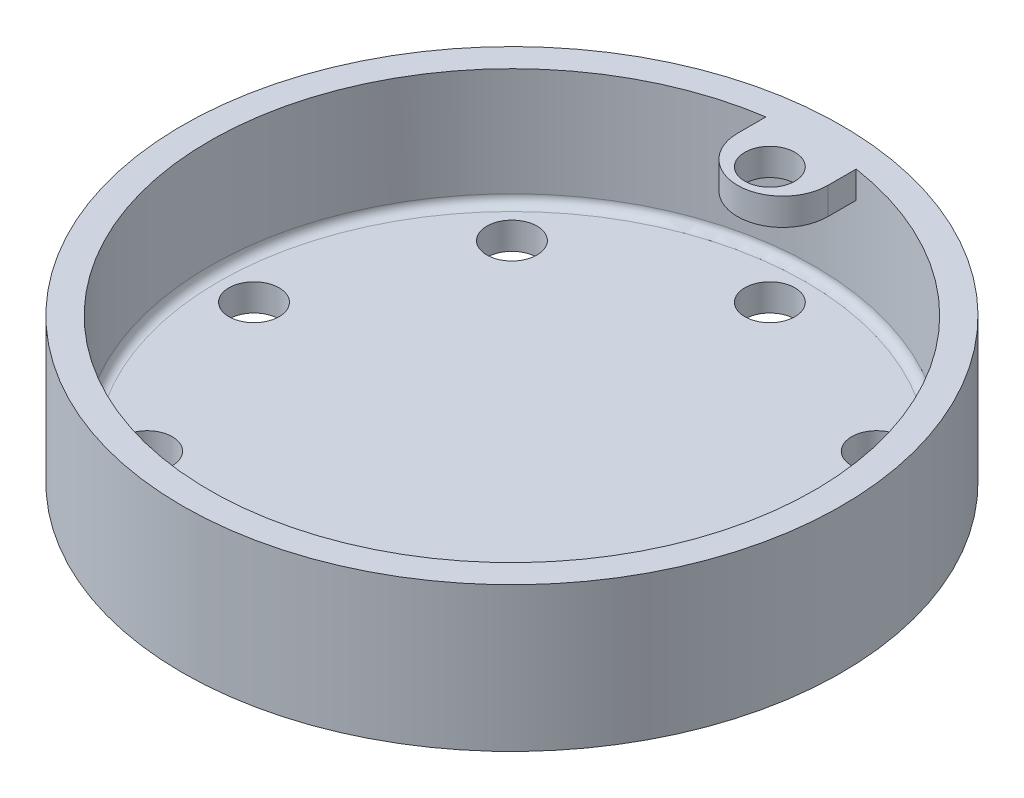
ISO-10303-21;
HEADER;
FILE_DESCRIPTION(('STEP AP214'),'2;1');
FILE_NAME('part.step','',(''),(''),'','','');
FILE_SCHEMA(('AUTOMOTIVE_DESIGN { 1 0 10303 214 1 1 1 1 }'));
ENDSEC;
DATA;
#1=APPLICATION_CONTEXT('core data for automotive mechanical design processes');
#2=APPLICATION_PROTOCOL_DEFINITION('international standard','automotive_design',2000,#1);
#3=PRODUCT_CONTEXT('',#1,'mechanical');
#4=PRODUCT('Part','Part','',(#3));
#5=PRODUCT_RELATED_PRODUCT_CATEGORY('part','',(#4));
#6=PRODUCT_DEFINITION_FORMATION('','',#4);
#7=PRODUCT_DEFINITION_CONTEXT('part definition',#1,'design');
#8=PRODUCT_DEFINITION('design','',#6,#7);
#9=PRODUCT_DEFINITION_SHAPE('','',#8);
#10=(LENGTH_UNIT() NAMED_UNIT(*) SI_UNIT(.MILLI.,.METRE.));
#11=(NAMED_UNIT(*) PLANE_ANGLE_UNIT() SI_UNIT($,.RADIAN.));
#12=(NAMED_UNIT(*) SI_UNIT($,.STERADIAN.) SOLID_ANGLE_UNIT());
#13=UNCERTAINTY_MEASURE_WITH_UNIT(LENGTH_MEASURE(1.E-05),#10,'distance_accuracy_value','');
#14=(GEOMETRIC_REPRESENTATION_CONTEXT(3) GLOBAL_UNCERTAINTY_ASSIGNED_CONTEXT((#13)) GLOBAL_UNIT_ASSIGNED_CONTEXT((#10,
#11,#12)) REPRESENTATION_CONTEXT('',''));
#15=CARTESIAN_POINT('',(0.,0.,0.));
#16=DIRECTION('',(0.,0.,1.));
#17=DIRECTION('',(1.,0.,0.));
#18=AXIS2_PLACEMENT_3D('',#15,#16,#17);
#19=CARTESIAN_POINT('',(0.,32.,0.));
#20=DIRECTION('',(0.,-1.,0.));
#21=DIRECTION('',(0.,0.,-1.));
#22=AXIS2_PLACEMENT_3D('',#19,#20,#21);
#23=CYLINDRICAL_SURFACE('',#22,67.025);
#24=CARTESIAN_POINT('',(0.,8.,0.));
#25=DIRECTION('',(0.,1.,0.));
#26=DIRECTION('',(0.,0.,1.));
#27=AXIS2_PLACEMENT_3D('',#24,#25,#26);
#28=CIRCLE('',#27,67.025);
#29=CARTESIAN_POINT('',(0.,8.,67.025));
#30=VERTEX_POINT('',#29);
#31=EDGE_CURVE('E11',#30,#30,#28,.F.);
#32=ORIENTED_EDGE('',*,*,#31,.T.);
#33=EDGE_LOOP('',(#32));
#34=FACE_BOUND('',#33,.T.);
#35=CARTESIAN_POINT('',(0.,32.,0.));
#36=DIRECTION('',(0.,1.,0.));
#37=DIRECTION('',(0.,0.,1.));
#38=AXIS2_PLACEMENT_3D('',#35,#36,#37);
#39=CIRCLE('',#38,67.025);
#40=CARTESIAN_POINT('',(-10.,32.,-66.2748113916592));
#41=VERTEX_POINT('',#40);
#42=CARTESIAN_POINT('',(10.,32.,-66.2748113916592));
#43=VERTEX_POINT('',#42);
#44=EDGE_CURVE('E107',#41,#43,#39,.T.);
#45=ORIENTED_EDGE('',*,*,#44,.T.);
#46=DIRECTION('',(0.,1.,0.));
#47=VECTOR('',#46,1.);
#48=CARTESIAN_POINT('',(10.,26.,-66.2748113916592));
#49=LINE('',#48,#47);
#50=CARTESIAN_POINT('',(10.,26.,-66.2748113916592));
#51=VERTEX_POINT('',#50);
#52=EDGE_CURVE('E52',#51,#43,#49,.T.);
#53=ORIENTED_EDGE('',*,*,#52,.F.);
#54=CARTESIAN_POINT('',(0.,26.,0.));
#55=DIRECTION('',(0.,1.,0.));
#56=DIRECTION('',(0.,0.,1.));
#57=AXIS2_PLACEMENT_3D('',#54,#55,#56);
#58=CIRCLE('',#57,67.025);
#59=CARTESIAN_POINT('',(-10.,26.,-66.2748113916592));
#60=VERTEX_POINT('',#59);
#61=EDGE_CURVE('E47',#51,#60,#58,.T.);
#62=ORIENTED_EDGE('',*,*,#61,.T.);
#63=DIRECTION('',(0.,1.,0.));
#64=VECTOR('',#63,1.);
#65=CARTESIAN_POINT('',(-10.,26.,-66.2748113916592));
#66=LINE('',#65,#64);
#67=EDGE_CURVE('E92',#60,#41,#66,.T.);
#68=ORIENTED_EDGE('',*,*,#67,.T.);
#69=EDGE_LOOP('',(#45,#53,#62,#68));
#70=FACE_BOUND('',#69,.T.);
#71=ADVANCED_FACE('F32',(#34,#70),#23,.F.);
#72=CARTESIAN_POINT('',(0.,32.,0.));
#73=DIRECTION('',(0.,-1.,0.));
#74=DIRECTION('',(0.,0.,-1.));
#75=AXIS2_PLACEMENT_3D('',#72,#73,#74);
#76=CYLINDRICAL_SURFACE('',#75,73.025);
#77=CARTESIAN_POINT('',(0.,32.,0.));
#78=DIRECTION('',(0.,1.,0.));
#79=DIRECTION('',(0.,0.,1.));
#80=AXIS2_PLACEMENT_3D('',#77,#78,#79);
#81=CIRCLE('',#80,73.025);
#82=CARTESIAN_POINT('',(0.,32.,73.025));
#83=VERTEX_POINT('',#82);
#84=EDGE_CURVE('E112',#83,#83,#81,.T.);
#85=ORIENTED_EDGE('',*,*,#84,.F.);
#86=EDGE_LOOP('',(#85));
#87=FACE_BOUND('',#86,.T.);
#88=CARTESIAN_POINT('',(0.,0.,0.));
#89=DIRECTION('',(0.,1.,0.));
#90=DIRECTION('',(0.,0.,1.));
#91=AXIS2_PLACEMENT_3D('',#88,#89,#90);
#92=CIRCLE('',#91,73.025);
#93=CARTESIAN_POINT('',(0.,0.,73.025));
#94=VERTEX_POINT('',#93);
#95=EDGE_CURVE('E111',#94,#94,#92,.T.);
#96=ORIENTED_EDGE('',*,*,#95,.T.);
#97=EDGE_LOOP('',(#96));
#98=FACE_BOUND('',#97,.T.);
#99=ADVANCED_FACE('F133',(#87,#98),#76,.T.);
#100=CARTESIAN_POINT('',(0.,32.,0.));
#101=DIRECTION('',(0.,1.,0.));
#102=DIRECTION('',(0.,0.,1.));
#103=AXIS2_PLACEMENT_3D('',#100,#101,#102);
#104=PLANE('',#103);
#105=CARTESIAN_POINT('',(0.,32.,-57.15));
#106=DIRECTION('',(0.,1.,0.));
#107=DIRECTION('',(0.,0.,1.));
#108=AXIS2_PLACEMENT_3D('',#105,#106,#107);
#109=CIRCLE('',#108,5.55625);
#110=CARTESIAN_POINT('',(0.,32.,-51.59375));
#111=VERTEX_POINT('',#110);
#112=EDGE_CURVE('E190',#111,#111,#109,.T.);
#113=ORIENTED_EDGE('',*,*,#112,.F.);
#114=EDGE_LOOP('',(#113));
#115=FACE_BOUND('',#114,.T.);
#116=ORIENTED_EDGE('',*,*,#44,.F.);
#117=DIRECTION('',(0.,0.,-1.));
#118=VECTOR('',#117,1.);
#119=CARTESIAN_POINT('',(-10.,32.,-60.));
#120=LINE('',#119,#118);
#121=CARTESIAN_POINT('',(-10.,32.,-60.));
#122=VERTEX_POINT('',#121);
#123=EDGE_CURVE('E101',#122,#41,#120,.T.);
#124=ORIENTED_EDGE('',*,*,#123,.F.);
#125=CARTESIAN_POINT('',(0.,32.,-60.));
#126=DIRECTION('',(0.,-1.,0.));
#127=DIRECTION('',(0.,0.,-1.));
#128=AXIS2_PLACEMENT_3D('',#125,#126,#127);
#129=CIRCLE('',#128,10.);
#130=CARTESIAN_POINT('',(10.,32.,-60.));
#131=VERTEX_POINT('',#130);
#132=EDGE_CURVE('E87',#131,#122,#129,.T.);
#133=ORIENTED_EDGE('',*,*,#132,.F.);
#134=DIRECTION('',(0.,0.,1.));
#135=VECTOR('',#134,1.);
#136=CARTESIAN_POINT('',(10.,32.,-66.2748113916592));
#137=LINE('',#136,#135);
#138=EDGE_CURVE('E96',#43,#131,#137,.T.);
#139=ORIENTED_EDGE('',*,*,#138,.F.);
#140=EDGE_LOOP('',(#116,#124,#133,#139));
#141=FACE_BOUND('',#140,.T.);
#142=ORIENTED_EDGE('',*,*,#84,.T.);
#143=EDGE_LOOP('',(#142));
#144=FACE_BOUND('',#143,.T.);
#145=ADVANCED_FACE('F139',(#115,#141,#144),#104,.T.);
#146=CARTESIAN_POINT('',(0.,0.,0.));
#147=DIRECTION('',(0.,1.,0.));
#148=DIRECTION('',(0.,0.,1.));
#149=AXIS2_PLACEMENT_3D('',#146,#147,#148);
#150=PLANE('',#149);
#151=CARTESIAN_POINT('',(-40.4111525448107,0.,-40.4111525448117));
#152=DIRECTION('',(0.,1.,0.));
#153=DIRECTION('',(0.707106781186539,0.,0.707106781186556));
#154=AXIS2_PLACEMENT_3D('',#151,#152,#153);
#155=CIRCLE('',#154,5.55625);
#156=CARTESIAN_POINT('',(-36.482290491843,0.,-36.4822904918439));
#157=VERTEX_POINT('',#156);
#158=EDGE_CURVE('E158',#157,#157,#155,.T.);
#159=ORIENTED_EDGE('',*,*,#158,.T.);
#160=EDGE_LOOP('',(#159));
#161=FACE_BOUND('',#160,.T.);
#162=CARTESIAN_POINT('',(-57.15,0.,-5.98614475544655E-13));
#163=DIRECTION('',(0.,1.,0.));
#164=DIRECTION('',(1.,0.,0.));
#165=AXIS2_PLACEMENT_3D('',#162,#163,#164);
#166=CIRCLE('',#165,5.55625);
#167=CARTESIAN_POINT('',(-51.59375,0.,-5.40415845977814E-13));
#168=VERTEX_POINT('',#167);
#169=EDGE_CURVE('E162',#168,#168,#166,.T.);
#170=ORIENTED_EDGE('',*,*,#169,.T.);
#171=EDGE_LOOP('',(#170));
#172=FACE_BOUND('',#171,.T.);
#173=CARTESIAN_POINT('',(-40.4111525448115,0.,40.4111525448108));
#174=DIRECTION('',(0.,1.,0.));
#175=DIRECTION('',(0.707106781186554,0.,-0.707106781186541));
#176=AXIS2_PLACEMENT_3D('',#173,#174,#175);
#177=CIRCLE('',#176,5.55625);
#178=CARTESIAN_POINT('',(-36.4822904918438,0.,36.4822904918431));
#179=VERTEX_POINT('',#178);
#180=EDGE_CURVE('E166',#179,#179,#177,.T.);
#181=ORIENTED_EDGE('',*,*,#180,.T.);
#182=EDGE_LOOP('',(#181));
#183=FACE_BOUND('',#182,.T.);
#184=CARTESIAN_POINT('',(-3.9907631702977E-13,0.,57.15));
#185=DIRECTION('',(0.,1.,0.));
#186=DIRECTION('',(0.,0.,-1.));
#187=AXIS2_PLACEMENT_3D('',#184,#185,#186);
#188=CIRCLE('',#187,5.55625);
#189=CARTESIAN_POINT('',(-3.60277230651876E-13,0.,51.59375));
#190=VERTEX_POINT('',#189);
#191=EDGE_CURVE('E170',#190,#190,#188,.T.);
#192=ORIENTED_EDGE('',*,*,#191,.T.);
#193=EDGE_LOOP('',(#192));
#194=FACE_BOUND('',#193,.T.);
#195=CARTESIAN_POINT('',(40.411152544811,0.,40.4111525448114));
#196=DIRECTION('',(0.,1.,0.));
#197=DIRECTION('',(-0.707106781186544,0.,-0.707106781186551));
#198=AXIS2_PLACEMENT_3D('',#195,#196,#197);
#199=CIRCLE('',#198,5.55625);
#200=CARTESIAN_POINT('',(36.4822904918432,0.,36.4822904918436));
#201=VERTEX_POINT('',#200);
#202=EDGE_CURVE('E174',#201,#201,#199,.T.);
#203=ORIENTED_EDGE('',*,*,#202,.T.);
#204=EDGE_LOOP('',(#203));
#205=FACE_BOUND('',#204,.T.);
#206=CARTESIAN_POINT('',(57.15,0.,1.99538158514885E-13));
#207=DIRECTION('',(0.,1.,0.));
#208=DIRECTION('',(-1.,0.,0.));
#209=AXIS2_PLACEMENT_3D('',#206,#207,#208);
#210=CIRCLE('',#209,5.55625);
#211=CARTESIAN_POINT('',(51.59375,0.,1.80138615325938E-13));
#212=VERTEX_POINT('',#211);
#213=EDGE_CURVE('E178',#212,#212,#210,.T.);
#214=ORIENTED_EDGE('',*,*,#213,.T.);
#215=EDGE_LOOP('',(#214));
#216=FACE_BOUND('',#215,.T.);
#217=CARTESIAN_POINT('',(40.4111525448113,0.,-40.4111525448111));
#218=DIRECTION('',(0.,1.,0.));
#219=DIRECTION('',(-0.707106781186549,0.,0.707106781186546));
#220=AXIS2_PLACEMENT_3D('',#217,#218,#219);
#221=CIRCLE('',#220,5.55625);
#222=CARTESIAN_POINT('',(36.4822904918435,0.,-36.4822904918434));
#223=VERTEX_POINT('',#222);
#224=EDGE_CURVE('E182',#223,#223,#221,.T.);
#225=ORIENTED_EDGE('',*,*,#224,.T.);
#226=EDGE_LOOP('',(#225));
#227=FACE_BOUND('',#226,.T.);
#228=CARTESIAN_POINT('',(0.,0.,-57.15));
#229=DIRECTION('',(0.,1.,0.));
#230=DIRECTION('',(0.,0.,1.));
#231=AXIS2_PLACEMENT_3D('',#228,#229,#230);
#232=CIRCLE('',#231,5.55625);
#233=CARTESIAN_POINT('',(0.,0.,-51.59375));
#234=VERTEX_POINT('',#233);
#235=EDGE_CURVE('E186',#234,#234,#232,.T.);
#236=ORIENTED_EDGE('',*,*,#235,.T.);
#237=EDGE_LOOP('',(#236));
#238=FACE_BOUND('',#237,.T.);
#239=ORIENTED_EDGE('',*,*,#95,.F.);
#240=EDGE_LOOP('',(#239));
#241=FACE_BOUND('',#240,.T.);
#242=ADVANCED_FACE('F147',(#161,#172,#183,#194,#205,#216,#227,#238,#241),#150,.F.);
#243=CARTESIAN_POINT('',(0.,6.,0.));
#244=DIRECTION('',(0.,1.,0.));
#245=DIRECTION('',(0.,0.,1.));
#246=AXIS2_PLACEMENT_3D('',#243,#244,#245);
#247=PLANE('',#246);
#248=CARTESIAN_POINT('',(0.,6.,0.));
#249=DIRECTION('',(0.,1.,0.));
#250=DIRECTION('',(0.,0.,1.));
#251=AXIS2_PLACEMENT_3D('',#248,#249,#250);
#252=CIRCLE('',#251,65.025);
#253=CARTESIAN_POINT('',(0.,6.,65.025));
#254=VERTEX_POINT('',#253);
#255=EDGE_CURVE('E40',#254,#254,#252,.T.);
#256=ORIENTED_EDGE('',*,*,#255,.T.);
#257=EDGE_LOOP('',(#256));
#258=FACE_BOUND('',#257,.T.);
#259=CARTESIAN_POINT('',(-40.4111525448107,6.,-40.4111525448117));
#260=DIRECTION('',(0.,1.,0.));
#261=DIRECTION('',(0.707106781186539,0.,0.707106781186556));
#262=AXIS2_PLACEMENT_3D('',#259,#260,#261);
#263=CIRCLE('',#262,5.55625);
#264=CARTESIAN_POINT('',(-36.482290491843,6.,-36.4822904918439));
#265=VERTEX_POINT('',#264);
#266=EDGE_CURVE('E347',#265,#265,#263,.T.);
#267=ORIENTED_EDGE('',*,*,#266,.F.);
#268=EDGE_LOOP('',(#267));
#269=FACE_BOUND('',#268,.T.);
#270=CARTESIAN_POINT('',(-57.15,6.,-5.98614475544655E-13));
#271=DIRECTION('',(0.,1.,0.));
#272=DIRECTION('',(1.,0.,0.));
#273=AXIS2_PLACEMENT_3D('',#270,#271,#272);
#274=CIRCLE('',#273,5.55625);
#275=CARTESIAN_POINT('',(-51.59375,6.,-5.40415845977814E-13));
#276=VERTEX_POINT('',#275);
#277=EDGE_CURVE('E342',#276,#276,#274,.T.);
#278=ORIENTED_EDGE('',*,*,#277,.F.);
#279=EDGE_LOOP('',(#278));
#280=FACE_BOUND('',#279,.T.);
#281=CARTESIAN_POINT('',(-40.4111525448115,6.,40.4111525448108));
#282=DIRECTION('',(0.,1.,0.));
#283=DIRECTION('',(0.707106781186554,0.,-0.707106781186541));
#284=AXIS2_PLACEMENT_3D('',#281,#282,#283);
#285=CIRCLE('',#284,5.55625);
#286=CARTESIAN_POINT('',(-36.4822904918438,6.,36.4822904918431));
#287=VERTEX_POINT('',#286);
#288=EDGE_CURVE('E345',#287,#287,#285,.T.);
#289=ORIENTED_EDGE('',*,*,#288,.F.);
#290=EDGE_LOOP('',(#289));
#291=FACE_BOUND('',#290,.T.);
#292=CARTESIAN_POINT('',(-3.9907631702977E-13,6.,57.15));
#293=DIRECTION('',(0.,1.,0.));
#294=DIRECTION('',(0.,0.,-1.));
#295=AXIS2_PLACEMENT_3D('',#292,#293,#294);
#296=CIRCLE('',#295,5.55625);
#297=CARTESIAN_POINT('',(-3.60277230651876E-13,6.,51.59375));
#298=VERTEX_POINT('',#297);
#299=EDGE_CURVE('E352',#298,#298,#296,.T.);
#300=ORIENTED_EDGE('',*,*,#299,.F.);
#301=EDGE_LOOP('',(#300));
#302=FACE_BOUND('',#301,.T.);
#303=CARTESIAN_POINT('',(40.411152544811,6.,40.4111525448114));
#304=DIRECTION('',(0.,1.,0.));
#305=DIRECTION('',(-0.707106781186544,0.,-0.707106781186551));
#306=AXIS2_PLACEMENT_3D('',#303,#304,#305);
#307=CIRCLE('',#306,5.55625);
#308=CARTESIAN_POINT('',(36.4822904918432,6.,36.4822904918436));
#309=VERTEX_POINT('',#308);
#310=EDGE_CURVE('E356',#309,#309,#307,.T.);
#311=ORIENTED_EDGE('',*,*,#310,.F.);
#312=EDGE_LOOP('',(#311));
#313=FACE_BOUND('',#312,.T.);
#314=CARTESIAN_POINT('',(57.15,6.,1.99538158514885E-13));
#315=DIRECTION('',(0.,1.,0.));
#316=DIRECTION('',(-1.,0.,0.));
#317=AXIS2_PLACEMENT_3D('',#314,#315,#316);
#318=CIRCLE('',#317,5.55625);
#319=CARTESIAN_POINT('',(51.59375,6.,1.80138615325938E-13));
#320=VERTEX_POINT('',#319);
#321=EDGE_CURVE('E360',#320,#320,#318,.T.);
#322=ORIENTED_EDGE('',*,*,#321,.F.);
#323=EDGE_LOOP('',(#322));
#324=FACE_BOUND('',#323,.T.);
#325=CARTESIAN_POINT('',(40.4111525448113,6.,-40.4111525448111));
#326=DIRECTION('',(0.,1.,0.));
#327=DIRECTION('',(-0.707106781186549,0.,0.707106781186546));
#328=AXIS2_PLACEMENT_3D('',#325,#326,#327);
#329=CIRCLE('',#328,5.55625);
#330=CARTESIAN_POINT('',(36.4822904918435,6.,-36.4822904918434));
#331=VERTEX_POINT('',#330);
#332=EDGE_CURVE('E198',#331,#331,#329,.T.);
#333=ORIENTED_EDGE('',*,*,#332,.F.);
#334=EDGE_LOOP('',(#333));
#335=FACE_BOUND('',#334,.T.);
#336=CARTESIAN_POINT('',(0.,6.,-57.15));
#337=DIRECTION('',(0.,1.,0.));
#338=DIRECTION('',(0.,0.,1.));
#339=AXIS2_PLACEMENT_3D('',#336,#337,#338);
#340=CIRCLE('',#339,5.55625);
#341=CARTESIAN_POINT('',(0.,6.,-51.59375));
#342=VERTEX_POINT('',#341);
#343=EDGE_CURVE('E191',#342,#342,#340,.T.);
#344=ORIENTED_EDGE('',*,*,#343,.F.);
#345=EDGE_LOOP('',(#344));
#346=FACE_BOUND('',#345,.T.);
#347=ADVANCED_FACE('F119',(#258,#269,#280,#291,#302,#313,#324,#335,#346),#247,.T.);
#348=CARTESIAN_POINT('',(10.,26.,-66.2748113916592));
#349=DIRECTION('',(-1.,0.,0.));
#350=DIRECTION('',(0.,0.,1.));
#351=AXIS2_PLACEMENT_3D('',#348,#349,#350);
#352=PLANE('',#351);
#353=ORIENTED_EDGE('',*,*,#138,.T.);
#354=DIRECTION('',(0.,1.,0.));
#355=VECTOR('',#354,1.);
#356=CARTESIAN_POINT('',(10.,26.,-60.));
#357=LINE('',#356,#355);
#358=CARTESIAN_POINT('',(10.,26.,-60.));
#359=VERTEX_POINT('',#358);
#360=EDGE_CURVE('E91',#359,#131,#357,.T.);
#361=ORIENTED_EDGE('',*,*,#360,.F.);
#362=DIRECTION('',(0.,0.,1.));
#363=VECTOR('',#362,1.);
#364=CARTESIAN_POINT('',(10.,26.,-66.2748113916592));
#365=LINE('',#364,#363);
#366=EDGE_CURVE('E78',#51,#359,#365,.T.);
#367=ORIENTED_EDGE('',*,*,#366,.F.);
#368=ORIENTED_EDGE('',*,*,#52,.T.);
#369=EDGE_LOOP('',(#353,#361,#367,#368));
#370=FACE_BOUND('',#369,.T.);
#371=ADVANCED_FACE('F146',(#370),#352,.F.);
#372=CARTESIAN_POINT('',(0.,26.,-60.));
#373=DIRECTION('',(0.,1.,0.));
#374=DIRECTION('',(0.,0.,1.));
#375=AXIS2_PLACEMENT_3D('',#372,#373,#374);
#376=CYLINDRICAL_SURFACE('',#375,10.);
#377=ORIENTED_EDGE('',*,*,#132,.T.);
#378=DIRECTION('',(0.,1.,0.));
#379=VECTOR('',#378,1.);
#380=CARTESIAN_POINT('',(-10.,26.,-60.));
#381=LINE('',#380,#379);
#382=CARTESIAN_POINT('',(-10.,26.,-60.));
#383=VERTEX_POINT('',#382);
#384=EDGE_CURVE('E84',#383,#122,#381,.T.);
#385=ORIENTED_EDGE('',*,*,#384,.F.);
#386=CARTESIAN_POINT('',(0.,26.,-60.));
#387=DIRECTION('',(0.,-1.,0.));
#388=DIRECTION('',(0.,0.,-1.));
#389=AXIS2_PLACEMENT_3D('',#386,#387,#388);
#390=CIRCLE('',#389,10.);
#391=EDGE_CURVE('E72',#359,#383,#390,.T.);
#392=ORIENTED_EDGE('',*,*,#391,.F.);
#393=ORIENTED_EDGE('',*,*,#360,.T.);
#394=EDGE_LOOP('',(#377,#385,#392,#393));
#395=FACE_BOUND('',#394,.T.);
#396=ADVANCED_FACE('F85',(#395),#376,.T.);
#397=CARTESIAN_POINT('',(-10.,26.,-60.));
#398=DIRECTION('',(1.,0.,0.));
#399=DIRECTION('',(0.,0.,-1.));
#400=AXIS2_PLACEMENT_3D('',#397,#398,#399);
#401=PLANE('',#400);
#402=ORIENTED_EDGE('',*,*,#123,.T.);
#403=ORIENTED_EDGE('',*,*,#67,.F.);
#404=DIRECTION('',(0.,0.,-1.));
#405=VECTOR('',#404,1.);
#406=CARTESIAN_POINT('',(-10.,26.,-60.));
#407=LINE('',#406,#405);
#408=EDGE_CURVE('E76',#383,#60,#407,.T.);
#409=ORIENTED_EDGE('',*,*,#408,.F.);
#410=ORIENTED_EDGE('',*,*,#384,.T.);
#411=EDGE_LOOP('',(#402,#403,#409,#410));
#412=FACE_BOUND('',#411,.T.);
#413=ADVANCED_FACE('F94',(#412),#401,.F.);
#414=CARTESIAN_POINT('',(0.,26.,0.));
#415=DIRECTION('',(0.,1.,0.));
#416=DIRECTION('',(0.,0.,1.));
#417=AXIS2_PLACEMENT_3D('',#414,#415,#416);
#418=PLANE('',#417);
#419=CARTESIAN_POINT('',(0.,26.,-57.15));
#420=DIRECTION('',(0.,1.,0.));
#421=DIRECTION('',(0.,0.,1.));
#422=AXIS2_PLACEMENT_3D('',#419,#420,#421);
#423=CIRCLE('',#422,5.55625);
#424=CARTESIAN_POINT('',(0.,26.,-51.59375));
#425=VERTEX_POINT('',#424);
#426=EDGE_CURVE('E103',#425,#425,#423,.F.);
#427=ORIENTED_EDGE('',*,*,#426,.F.);
#428=EDGE_LOOP('',(#427));
#429=FACE_BOUND('',#428,.T.);
#430=ORIENTED_EDGE('',*,*,#61,.F.);
#431=ORIENTED_EDGE('',*,*,#366,.T.);
#432=ORIENTED_EDGE('',*,*,#391,.T.);
#433=ORIENTED_EDGE('',*,*,#408,.T.);
#434=EDGE_LOOP('',(#430,#431,#432,#433));
#435=FACE_BOUND('',#434,.T.);
#436=ADVANCED_FACE('F74',(#429,#435),#418,.F.);
#437=CARTESIAN_POINT('',(0.,-0.001000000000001,-57.15));
#438=DIRECTION('',(0.,1.,0.));
#439=DIRECTION('',(0.,0.,1.));
#440=AXIS2_PLACEMENT_3D('',#437,#438,#439);
#441=CYLINDRICAL_SURFACE('',#440,5.55625);
#442=ORIENTED_EDGE('',*,*,#112,.T.);
#443=EDGE_LOOP('',(#442));
#444=FACE_BOUND('',#443,.T.);
#445=ORIENTED_EDGE('',*,*,#426,.T.);
#446=EDGE_LOOP('',(#445));
#447=FACE_BOUND('',#446,.T.);
#448=ADVANCED_FACE('F203',(#444,#447),#441,.F.);
#449=CARTESIAN_POINT('',(0.,0.,-57.15));
#450=DIRECTION('',(0.,1.,0.));
#451=DIRECTION('',(0.,0.,1.));
#452=AXIS2_PLACEMENT_3D('',#449,#450,#451);
#453=CYLINDRICAL_SURFACE('',#452,5.55625);
#454=ORIENTED_EDGE('',*,*,#235,.F.);
#455=EDGE_LOOP('',(#454));
#456=FACE_BOUND('',#455,.T.);
#457=ORIENTED_EDGE('',*,*,#343,.T.);
#458=EDGE_LOOP('',(#457));
#459=FACE_BOUND('',#458,.T.);
#460=ADVANCED_FACE('F211',(#456,#459),#453,.F.);
#461=CARTESIAN_POINT('',(40.4111525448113,0.,-40.4111525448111));
#462=DIRECTION('',(0.,1.,0.));
#463=DIRECTION('',(0.,0.,1.));
#464=AXIS2_PLACEMENT_3D('',#461,#462,#463);
#465=CYLINDRICAL_SURFACE('',#464,5.55625);
#466=ORIENTED_EDGE('',*,*,#224,.F.);
#467=EDGE_LOOP('',(#466));
#468=FACE_BOUND('',#467,.T.);
#469=ORIENTED_EDGE('',*,*,#332,.T.);
#470=EDGE_LOOP('',(#469));
#471=FACE_BOUND('',#470,.T.);
#472=ADVANCED_FACE('F254',(#468,#471),#465,.F.);
#473=CARTESIAN_POINT('',(57.15,0.,1.99538158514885E-13));
#474=DIRECTION('',(0.,1.,0.));
#475=DIRECTION('',(0.,0.,1.));
#476=AXIS2_PLACEMENT_3D('',#473,#474,#475);
#477=CYLINDRICAL_SURFACE('',#476,5.55625);
#478=ORIENTED_EDGE('',*,*,#213,.F.);
#479=EDGE_LOOP('',(#478));
#480=FACE_BOUND('',#479,.T.);
#481=ORIENTED_EDGE('',*,*,#321,.T.);
#482=EDGE_LOOP('',(#481));
#483=FACE_BOUND('',#482,.T.);
#484=ADVANCED_FACE('F268',(#480,#483),#477,.F.);
#485=CARTESIAN_POINT('',(40.411152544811,0.,40.4111525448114));
#486=DIRECTION('',(0.,1.,0.));
#487=DIRECTION('',(0.,0.,1.));
#488=AXIS2_PLACEMENT_3D('',#485,#486,#487);
#489=CYLINDRICAL_SURFACE('',#488,5.55625);
#490=ORIENTED_EDGE('',*,*,#202,.F.);
#491=EDGE_LOOP('',(#490));
#492=FACE_BOUND('',#491,.T.);
#493=ORIENTED_EDGE('',*,*,#310,.T.);
#494=EDGE_LOOP('',(#493));
#495=FACE_BOUND('',#494,.T.);
#496=ADVANCED_FACE('F278',(#492,#495),#489,.F.);
#497=CARTESIAN_POINT('',(-3.9907631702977E-13,0.,57.15));
#498=DIRECTION('',(0.,1.,0.));
#499=DIRECTION('',(0.,0.,1.));
#500=AXIS2_PLACEMENT_3D('',#497,#498,#499);
#501=CYLINDRICAL_SURFACE('',#500,5.55625);
#502=ORIENTED_EDGE('',*,*,#191,.F.);
#503=EDGE_LOOP('',(#502));
#504=FACE_BOUND('',#503,.T.);
#505=ORIENTED_EDGE('',*,*,#299,.T.);
#506=EDGE_LOOP('',(#505));
#507=FACE_BOUND('',#506,.T.);
#508=ADVANCED_FACE('F288',(#504,#507),#501,.F.);
#509=CARTESIAN_POINT('',(-40.4111525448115,0.,40.4111525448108));
#510=DIRECTION('',(0.,1.,0.));
#511=DIRECTION('',(0.,0.,1.));
#512=AXIS2_PLACEMENT_3D('',#509,#510,#511);
#513=CYLINDRICAL_SURFACE('',#512,5.55625);
#514=ORIENTED_EDGE('',*,*,#180,.F.);
#515=EDGE_LOOP('',(#514));
#516=FACE_BOUND('',#515,.T.);
#517=ORIENTED_EDGE('',*,*,#288,.T.);
#518=EDGE_LOOP('',(#517));
#519=FACE_BOUND('',#518,.T.);
#520=ADVANCED_FACE('F298',(#516,#519),#513,.F.);
#521=CARTESIAN_POINT('',(-57.15,0.,-5.98614475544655E-13));
#522=DIRECTION('',(0.,1.,0.));
#523=DIRECTION('',(0.,0.,1.));
#524=AXIS2_PLACEMENT_3D('',#521,#522,#523);
#525=CYLINDRICAL_SURFACE('',#524,5.55625);
#526=ORIENTED_EDGE('',*,*,#169,.F.);
#527=EDGE_LOOP('',(#526));
#528=FACE_BOUND('',#527,.T.);
#529=ORIENTED_EDGE('',*,*,#277,.T.);
#530=EDGE_LOOP('',(#529));
#531=FACE_BOUND('',#530,.T.);
#532=ADVANCED_FACE('F128',(#528,#531),#525,.F.);
#533=CARTESIAN_POINT('',(-40.4111525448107,0.,-40.4111525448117));
#534=DIRECTION('',(0.,1.,0.));
#535=DIRECTION('',(0.,0.,1.));
#536=AXIS2_PLACEMENT_3D('',#533,#534,#535);
#537=CYLINDRICAL_SURFACE('',#536,5.55625);
#538=ORIENTED_EDGE('',*,*,#158,.F.);
#539=EDGE_LOOP('',(#538));
#540=FACE_BOUND('',#539,.T.);
#541=ORIENTED_EDGE('',*,*,#266,.T.);
#542=EDGE_LOOP('',(#541));
#543=FACE_BOUND('',#542,.T.);
#544=ADVANCED_FACE('F123',(#540,#543),#537,.F.);
#545=CARTESIAN_POINT('',(0.,8.,0.));
#546=DIRECTION('',(0.,1.,0.));
#547=DIRECTION('',(0.,0.,1.));
#548=AXIS2_PLACEMENT_3D('',#545,#546,#547);
#549=TOROIDAL_SURFACE('',#548,65.025,2.);
#550=ORIENTED_EDGE('',*,*,#31,.F.);
#551=EDGE_LOOP('',(#550));
#552=FACE_BOUND('',#551,.T.);
#553=ORIENTED_EDGE('',*,*,#255,.F.);
#554=EDGE_LOOP('',(#553));
#555=FACE_BOUND('',#554,.T.);
#556=ADVANCED_FACE('F34',(#552,#555),#549,.F.);
#557=CLOSED_SHELL('',(#71,#99,#145,#242,#347,#371,#396,#413,#436,#448,#460,#472,#484,#496,#508,
#520,#532,#544,#556));
#558=MANIFOLD_SOLID_BREP('B2',#557);
#559=ADVANCED_BREP_SHAPE_REPRESENTATION('',(#18,#558),#14);
#560=SHAPE_DEFINITION_REPRESENTATION(#9,#559);
ENDSEC;
END-ISO-10303-21;
